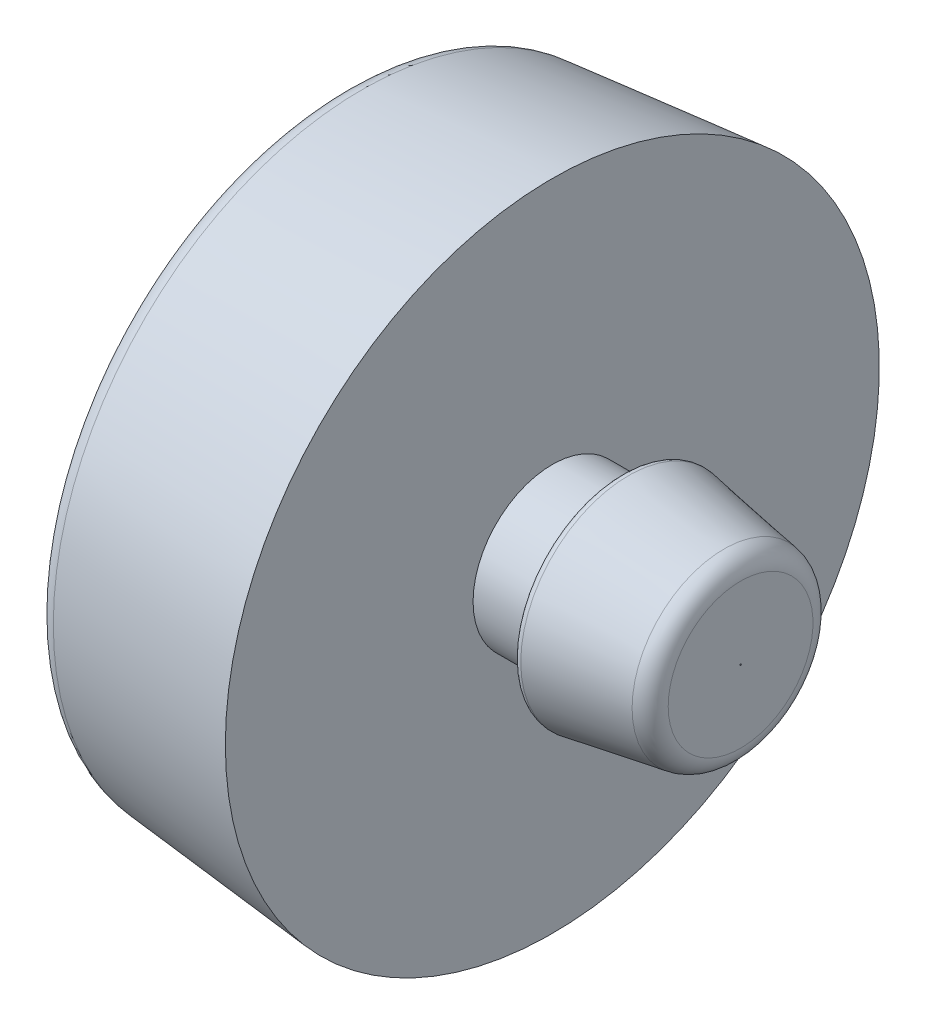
from build123d import *


with BuildPart() as part:
    # Esquisse1 → R_volution1 (revolve)
    with BuildSketch(Plane.XY, mode=Mode.PRIVATE) as r_volution1_sk:
        with BuildLine():
            Line((0, 0.034873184), (0, 14.590713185))
            ThreePointArc((0, 14.590713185), (0.260132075, 15.263465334), (0.905190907, 15.586208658))
            Line((0.905190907, 15.586208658), (10.5, 16.5))
            Line((10.5, 16.5), (10.5, 4))
            Line((10.5, 4), (14, 4))
            Line((14, 4), (14, 5.145861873))
            ThreePointArc((14, 5.145861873), (14.106087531, 5.374767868), (14.349319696, 5.441780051))
            Line((14.349319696, 5.441780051), (19.164398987, 4.639266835))
            ThreePointArc((19.164398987, 4.639266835), (19.763019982, 4.299247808), (20, 3.652872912))
            Line((20, 3.652872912), (20, 0.034873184))
            Line((20, 0.034873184), (0, 0.034873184))
        make_face()
    revolve(r_volution1_sk.sketch.rotate(Axis((-8.558461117, 0, 0), (1, 0, 0)), 90), axis=Axis((-8.558461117, 0, 0), (1, 0, 0)))


solid = part.part
